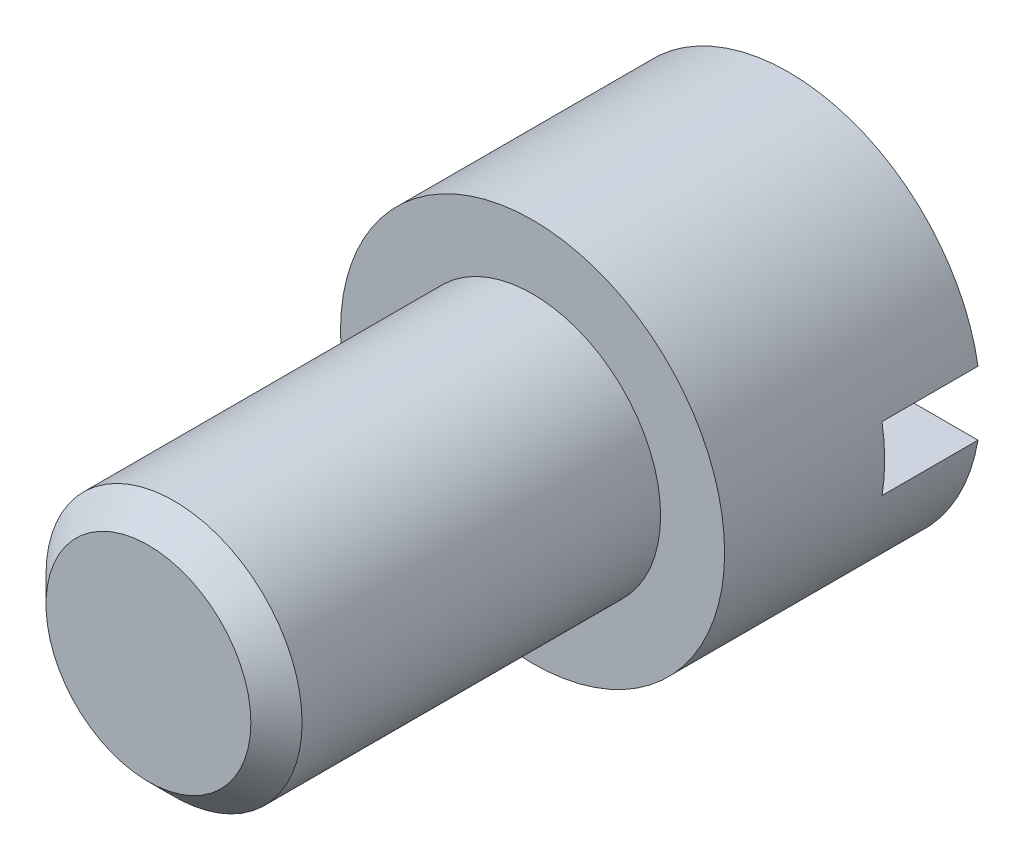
ISO-10303-21;
HEADER;
FILE_DESCRIPTION(('STEP AP214'),'2;1');
FILE_NAME('part.step','',(''),(''),'','','');
FILE_SCHEMA(('AUTOMOTIVE_DESIGN { 1 0 10303 214 1 1 1 1 }'));
ENDSEC;
DATA;
#1=APPLICATION_CONTEXT('core data for automotive mechanical design processes');
#2=APPLICATION_PROTOCOL_DEFINITION('international standard','automotive_design',2000,#1);
#3=PRODUCT_CONTEXT('',#1,'mechanical');
#4=PRODUCT('Part','Part','',(#3));
#5=PRODUCT_RELATED_PRODUCT_CATEGORY('part','',(#4));
#6=PRODUCT_DEFINITION_FORMATION('','',#4);
#7=PRODUCT_DEFINITION_CONTEXT('part definition',#1,'design');
#8=PRODUCT_DEFINITION('design','',#6,#7);
#9=PRODUCT_DEFINITION_SHAPE('','',#8);
#10=(LENGTH_UNIT() NAMED_UNIT(*) SI_UNIT(.MILLI.,.METRE.));
#11=(NAMED_UNIT(*) PLANE_ANGLE_UNIT() SI_UNIT($,.RADIAN.));
#12=(NAMED_UNIT(*) SI_UNIT($,.STERADIAN.) SOLID_ANGLE_UNIT());
#13=UNCERTAINTY_MEASURE_WITH_UNIT(LENGTH_MEASURE(1.E-05),#10,'distance_accuracy_value','');
#14=(GEOMETRIC_REPRESENTATION_CONTEXT(3) GLOBAL_UNCERTAINTY_ASSIGNED_CONTEXT((#13)) GLOBAL_UNIT_ASSIGNED_CONTEXT((#10,
#11,#12)) REPRESENTATION_CONTEXT('',''));
#15=CARTESIAN_POINT('',(0.,0.,0.));
#16=DIRECTION('',(0.,0.,1.));
#17=DIRECTION('',(1.,0.,0.));
#18=AXIS2_PLACEMENT_3D('',#15,#16,#17);
#19=CARTESIAN_POINT('',(0.,0.,-2.));
#20=DIRECTION('',(0.,0.,-1.));
#21=DIRECTION('',(-1.,0.,0.));
#22=AXIS2_PLACEMENT_3D('',#19,#20,#21);
#23=PLANE('',#22);
#24=DIRECTION('',(1.,0.,0.));
#25=VECTOR('',#24,1.);
#26=CARTESIAN_POINT('',(0.,0.25,-2.));
#27=LINE('',#26,#25);
#28=CARTESIAN_POINT('',(-1.4790199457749,0.25,-2.));
#29=VERTEX_POINT('',#28);
#30=CARTESIAN_POINT('',(1.4790199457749,0.25,-2.));
#31=VERTEX_POINT('',#30);
#32=EDGE_CURVE('E80',#29,#31,#27,.T.);
#33=ORIENTED_EDGE('',*,*,#32,.F.);
#34=CARTESIAN_POINT('',(0.,0.,-2.));
#35=DIRECTION('',(0.,0.,-1.));
#36=DIRECTION('',(-1.,0.,0.));
#37=AXIS2_PLACEMENT_3D('',#34,#35,#36);
#38=CIRCLE('',#37,1.5);
#39=EDGE_CURVE('E93',#29,#31,#38,.T.);
#40=ORIENTED_EDGE('',*,*,#39,.T.);
#41=EDGE_LOOP('',(#33,#40));
#42=FACE_BOUND('',#41,.T.);
#43=ADVANCED_FACE('F33',(#42),#23,.T.);
#44=CARTESIAN_POINT('',(0.,0.,3.));
#45=DIRECTION('',(0.,0.,-1.));
#46=DIRECTION('',(-1.,0.,0.));
#47=AXIS2_PLACEMENT_3D('',#44,#45,#46);
#48=CYLINDRICAL_SURFACE('',#47,1.);
#49=CARTESIAN_POINT('',(0.,0.,2.8));
#50=DIRECTION('',(0.,0.,1.));
#51=DIRECTION('',(1.,0.,0.));
#52=AXIS2_PLACEMENT_3D('',#49,#50,#51);
#53=CIRCLE('',#52,1.);
#54=CARTESIAN_POINT('',(1.,0.,2.8));
#55=VERTEX_POINT('',#54);
#56=EDGE_CURVE('E81',#55,#55,#53,.F.);
#57=ORIENTED_EDGE('',*,*,#56,.T.);
#58=EDGE_LOOP('',(#57));
#59=FACE_BOUND('',#58,.T.);
#60=CARTESIAN_POINT('',(0.,0.,0.));
#61=DIRECTION('',(0.,0.,-1.));
#62=DIRECTION('',(-1.,0.,0.));
#63=AXIS2_PLACEMENT_3D('',#60,#61,#62);
#64=CIRCLE('',#63,1.);
#65=CARTESIAN_POINT('',(-1.,0.,0.));
#66=VERTEX_POINT('',#65);
#67=EDGE_CURVE('E97',#66,#66,#64,.T.);
#68=ORIENTED_EDGE('',*,*,#67,.F.);
#69=EDGE_LOOP('',(#68));
#70=FACE_BOUND('',#69,.T.);
#71=ADVANCED_FACE('F121',(#59,#70),#48,.T.);
#72=CARTESIAN_POINT('',(0.,0.,3.));
#73=DIRECTION('',(0.,0.,1.));
#74=DIRECTION('',(1.,0.,0.));
#75=AXIS2_PLACEMENT_3D('',#72,#73,#74);
#76=PLANE('',#75);
#77=CARTESIAN_POINT('',(0.,0.,3.));
#78=DIRECTION('',(0.,0.,1.));
#79=DIRECTION('',(1.,0.,0.));
#80=AXIS2_PLACEMENT_3D('',#77,#78,#79);
#81=CIRCLE('',#80,0.799999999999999);
#82=CARTESIAN_POINT('',(0.799999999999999,0.,3.));
#83=VERTEX_POINT('',#82);
#84=EDGE_CURVE('E106',#83,#83,#81,.T.);
#85=ORIENTED_EDGE('',*,*,#84,.T.);
#86=EDGE_LOOP('',(#85));
#87=FACE_BOUND('',#86,.T.);
#88=ADVANCED_FACE('F126',(#87),#76,.T.);
#89=CARTESIAN_POINT('',(0.,0.,3.));
#90=DIRECTION('',(0.,0.,-1.));
#91=DIRECTION('',(-1.,0.,0.));
#92=AXIS2_PLACEMENT_3D('',#89,#90,#91);
#93=CONICAL_SURFACE('',#92,0.799999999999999,0.785398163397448);
#94=ORIENTED_EDGE('',*,*,#56,.F.);
#95=EDGE_LOOP('',(#94));
#96=FACE_BOUND('',#95,.T.);
#97=ORIENTED_EDGE('',*,*,#84,.F.);
#98=EDGE_LOOP('',(#97));
#99=FACE_BOUND('',#98,.T.);
#100=ADVANCED_FACE('F35',(#96,#99),#93,.T.);
#101=CARTESIAN_POINT('',(0.,0.,0.));
#102=DIRECTION('',(0.,0.,-1.));
#103=DIRECTION('',(-1.,0.,0.));
#104=AXIS2_PLACEMENT_3D('',#101,#102,#103);
#105=PLANE('',#104);
#106=CARTESIAN_POINT('',(0.,0.,0.));
#107=DIRECTION('',(0.,0.,-1.));
#108=DIRECTION('',(-1.,0.,0.));
#109=AXIS2_PLACEMENT_3D('',#106,#107,#108);
#110=CIRCLE('',#109,1.5);
#111=CARTESIAN_POINT('',(-1.5,0.,0.));
#112=VERTEX_POINT('',#111);
#113=EDGE_CURVE('E94',#112,#112,#110,.T.);
#114=ORIENTED_EDGE('',*,*,#113,.F.);
#115=EDGE_LOOP('',(#114));
#116=FACE_BOUND('',#115,.T.);
#117=ORIENTED_EDGE('',*,*,#67,.T.);
#118=EDGE_LOOP('',(#117));
#119=FACE_BOUND('',#118,.T.);
#120=ADVANCED_FACE('F136',(#116,#119),#105,.F.);
#121=CARTESIAN_POINT('',(0.,0.,-2.));
#122=DIRECTION('',(0.,0.,1.));
#123=DIRECTION('',(1.,0.,0.));
#124=AXIS2_PLACEMENT_3D('',#121,#122,#123);
#125=CYLINDRICAL_SURFACE('',#124,1.5);
#126=CARTESIAN_POINT('',(0.,0.,-1.25));
#127=DIRECTION('',(0.,0.,-1.));
#128=DIRECTION('',(-1.,0.,0.));
#129=AXIS2_PLACEMENT_3D('',#126,#127,#128);
#130=CIRCLE('',#129,1.5);
#131=CARTESIAN_POINT('',(1.4790199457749,0.25,-1.25));
#132=VERTEX_POINT('',#131);
#133=CARTESIAN_POINT('',(1.4790199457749,-0.25,-1.25));
#134=VERTEX_POINT('',#133);
#135=EDGE_CURVE('E11',#132,#134,#130,.T.);
#136=ORIENTED_EDGE('',*,*,#135,.F.);
#137=DIRECTION('',(0.,0.,1.));
#138=VECTOR('',#137,1.);
#139=CARTESIAN_POINT('',(1.4790199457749,0.25,-2.));
#140=LINE('',#139,#138);
#141=EDGE_CURVE('E56',#132,#31,#140,.F.);
#142=ORIENTED_EDGE('',*,*,#141,.T.);
#143=ORIENTED_EDGE('',*,*,#39,.F.);
#144=DIRECTION('',(0.,0.,1.));
#145=VECTOR('',#144,1.);
#146=CARTESIAN_POINT('',(-1.4790199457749,0.25,-2.));
#147=LINE('',#146,#145);
#148=CARTESIAN_POINT('',(-1.4790199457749,0.25,-1.25));
#149=VERTEX_POINT('',#148);
#150=EDGE_CURVE('E99',#29,#149,#147,.T.);
#151=ORIENTED_EDGE('',*,*,#150,.T.);
#152=CARTESIAN_POINT('',(-1.4790199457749,-0.25,-1.25));
#153=VERTEX_POINT('',#152);
#154=EDGE_CURVE('E37',#153,#149,#130,.T.);
#155=ORIENTED_EDGE('',*,*,#154,.F.);
#156=DIRECTION('',(0.,0.,1.));
#157=VECTOR('',#156,1.);
#158=CARTESIAN_POINT('',(-1.4790199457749,-0.25,-2.));
#159=LINE('',#158,#157);
#160=CARTESIAN_POINT('',(-1.4790199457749,-0.25,-2.));
#161=VERTEX_POINT('',#160);
#162=EDGE_CURVE('E75',#153,#161,#159,.F.);
#163=ORIENTED_EDGE('',*,*,#162,.T.);
#164=CARTESIAN_POINT('',(1.4790199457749,-0.25,-2.));
#165=VERTEX_POINT('',#164);
#166=EDGE_CURVE('E88',#165,#161,#38,.T.);
#167=ORIENTED_EDGE('',*,*,#166,.F.);
#168=DIRECTION('',(0.,0.,1.));
#169=VECTOR('',#168,1.);
#170=CARTESIAN_POINT('',(1.4790199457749,-0.25,-2.));
#171=LINE('',#170,#169);
#172=EDGE_CURVE('E48',#165,#134,#171,.T.);
#173=ORIENTED_EDGE('',*,*,#172,.T.);
#174=EDGE_LOOP('',(#136,#142,#143,#151,#155,#163,#167,#173));
#175=FACE_BOUND('',#174,.T.);
#176=ORIENTED_EDGE('',*,*,#113,.T.);
#177=EDGE_LOOP('',(#176));
#178=FACE_BOUND('',#177,.T.);
#179=ADVANCED_FACE('F86',(#175,#178),#125,.T.);
#180=DIRECTION('',(-1.,0.,0.));
#181=VECTOR('',#180,1.);
#182=CARTESIAN_POINT('',(0.,-0.25,-2.));
#183=LINE('',#182,#181);
#184=EDGE_CURVE('E72',#165,#161,#183,.T.);
#185=ORIENTED_EDGE('',*,*,#184,.F.);
#186=ORIENTED_EDGE('',*,*,#166,.T.);
#187=EDGE_LOOP('',(#185,#186));
#188=FACE_BOUND('',#187,.T.);
#189=ADVANCED_FACE('F92',(#188),#23,.T.);
#190=CARTESIAN_POINT('',(0.,0.,-1.25));
#191=DIRECTION('',(0.,0.,-1.));
#192=DIRECTION('',(-1.,0.,0.));
#193=AXIS2_PLACEMENT_3D('',#190,#191,#192);
#194=PLANE('',#193);
#195=ORIENTED_EDGE('',*,*,#135,.T.);
#196=DIRECTION('',(-1.,0.,0.));
#197=VECTOR('',#196,1.);
#198=CARTESIAN_POINT('',(2.,-0.25,-1.25));
#199=LINE('',#198,#197);
#200=EDGE_CURVE('E113',#134,#153,#199,.T.);
#201=ORIENTED_EDGE('',*,*,#200,.T.);
#202=ORIENTED_EDGE('',*,*,#154,.T.);
#203=DIRECTION('',(1.,0.,0.));
#204=VECTOR('',#203,1.);
#205=CARTESIAN_POINT('',(2.,0.25,-1.25));
#206=LINE('',#205,#204);
#207=EDGE_CURVE('E90',#149,#132,#206,.T.);
#208=ORIENTED_EDGE('',*,*,#207,.T.);
#209=EDGE_LOOP('',(#195,#201,#202,#208));
#210=FACE_BOUND('',#209,.T.);
#211=ADVANCED_FACE('F112',(#210),#194,.T.);
#212=CARTESIAN_POINT('',(2.,0.25,-1.25));
#213=DIRECTION('',(0.,1.,0.));
#214=DIRECTION('',(0.,0.,1.));
#215=AXIS2_PLACEMENT_3D('',#212,#213,#214);
#216=PLANE('',#215);
#217=ORIENTED_EDGE('',*,*,#32,.T.);
#218=ORIENTED_EDGE('',*,*,#141,.F.);
#219=ORIENTED_EDGE('',*,*,#207,.F.);
#220=ORIENTED_EDGE('',*,*,#150,.F.);
#221=EDGE_LOOP('',(#217,#218,#219,#220));
#222=FACE_BOUND('',#221,.T.);
#223=ADVANCED_FACE('F114',(#222),#216,.F.);
#224=CARTESIAN_POINT('',(2.,-0.25,-1.25));
#225=DIRECTION('',(0.,-1.,0.));
#226=DIRECTION('',(0.,0.,-1.));
#227=AXIS2_PLACEMENT_3D('',#224,#225,#226);
#228=PLANE('',#227);
#229=ORIENTED_EDGE('',*,*,#184,.T.);
#230=ORIENTED_EDGE('',*,*,#162,.F.);
#231=ORIENTED_EDGE('',*,*,#200,.F.);
#232=ORIENTED_EDGE('',*,*,#172,.F.);
#233=EDGE_LOOP('',(#229,#230,#231,#232));
#234=FACE_BOUND('',#233,.T.);
#235=ADVANCED_FACE('F74',(#234),#228,.F.);
#236=CLOSED_SHELL('',(#43,#71,#88,#100,#120,#179,#189,#211,#223,#235));
#237=MANIFOLD_SOLID_BREP('B2',#236);
#238=ADVANCED_BREP_SHAPE_REPRESENTATION('',(#18,#237),#14);
#239=SHAPE_DEFINITION_REPRESENTATION(#9,#238);
ENDSEC;
END-ISO-10303-21;
